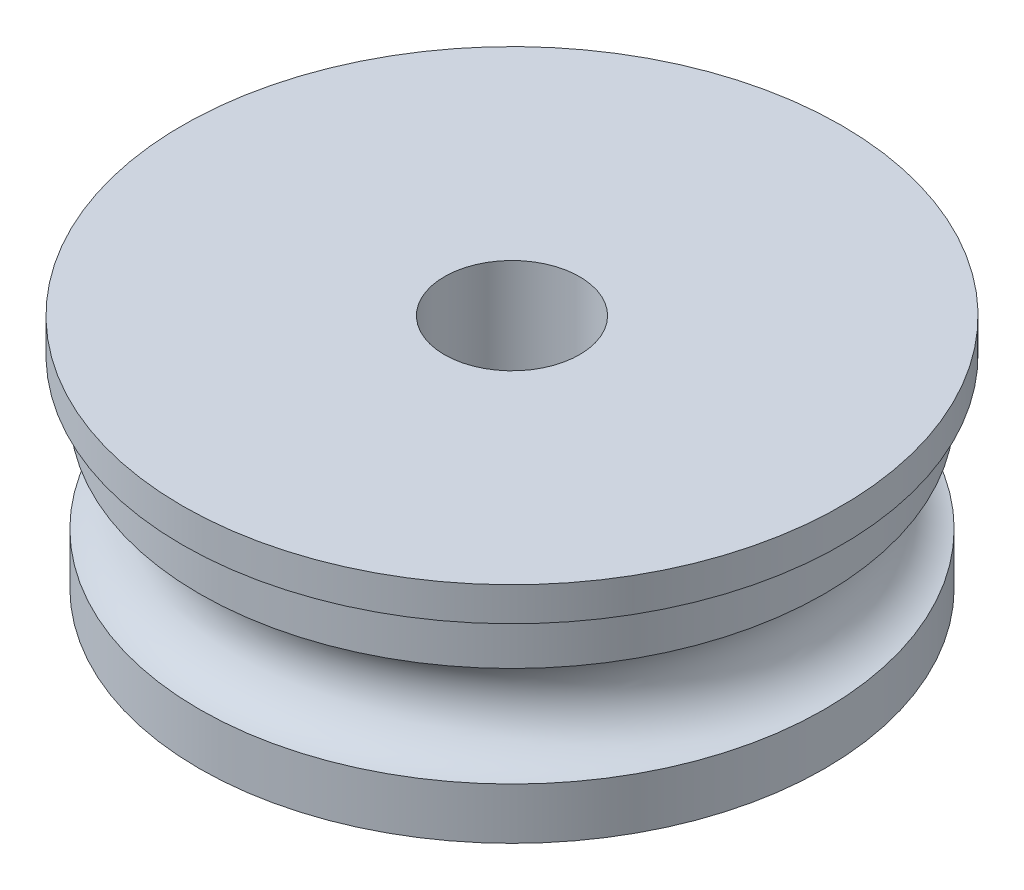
from build123d import *


with BuildPart() as part:
    # Sketch1 → Revolve1 (revolve)
    with BuildSketch(Plane.XY, mode=Mode.PRIVATE) as revolve1_sk:
        with BuildLine():
            Line((-9.75, 6.980351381), (-2, 6.980351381))
            Line((-2, 6.980351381), (-2, 3))
            Line((-2, 3), (-6, 3))
            Line((-6, 3), (-6, 0))
            Line((-6, 0), (-9.25, 0))
            Line((-9.25, 0), (-9.25, 1.519648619))
            ThreePointArc((-9.25, 1.519648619), (-7.991991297, 3), (-9.25, 4.480351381))
            Line((-9.25, 4.480351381), (-9.25, 5.980351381))
            Line((-9.25, 5.980351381), (-9.75, 5.980351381))
            Line((-9.75, 5.980351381), (-9.75, 6.980351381))
        make_face()
    revolve(revolve1_sk.sketch.rotate(Axis((0, 0, 0), (0, -1, 0)), 270), axis=Axis((0, 0, 0), (0, -1, 0)))


solid = part.part
